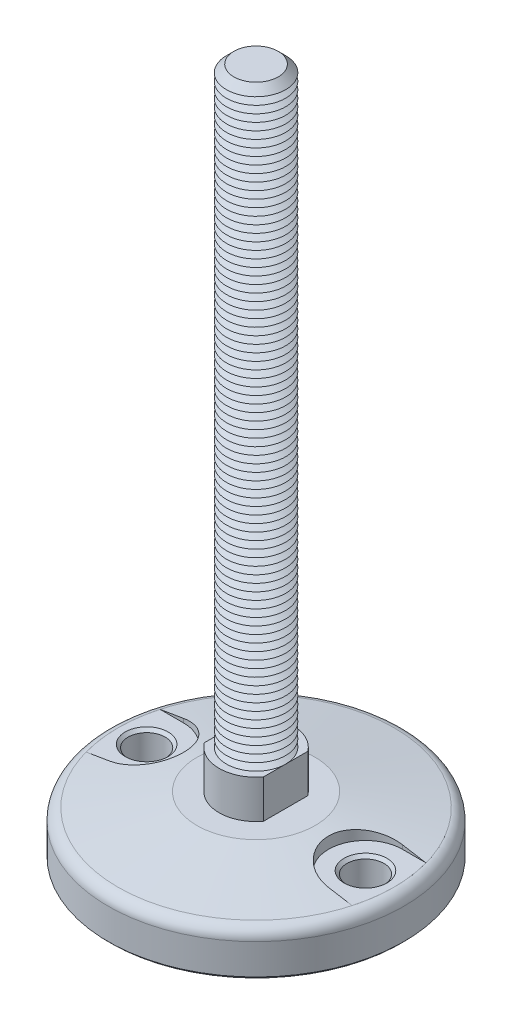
from build123d import *

# Parameters (mm, degrees)
FILLET1_R                = 4
SKETCH3_R                = 12.5
BOSS_EXTRUDE1_DEPTH      = 13
CUT_EXTRUDE1_START       = -13
CUT_EXTRUDE1_DEPTH       = 13
SKETCH5_R                = 10
BOSS_EXTRUDE2_DEPTH      = 200
CHAMFER1_SIZE            = 2.5
LPATTERN1_COUNT          = 79
LPATTERN1_PITCH          = 2.5
CUT_EXTRUDE4_DEPTH       = 4.7
SKETCH10_R               = 6.25
CUT_EXTRUDE5_DEPTH       = 15.3
CHAMFER2_SIZE            = 1
CHAMFER2_OF_MIRROR1_SIZE = 1
CHAMFER3_SIZE            = 1


with BuildPart() as part:
    # Sketch2 → Revolve1 (revolve)
    with BuildSketch(Plane(origin=(0, 0, 0), x_dir=(0, 0, -1), z_dir=(1, 0, 0))):
        Polygon((0, 0), (-20, 0), (-50, -5.289809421), (-50, -20), (0, -20), align=None)
    revolve(axis=Axis((0, 61.338865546, 0), (0, -1, 0)))

    # Fillet1
    fillet1_edges = [part.edges().sort_by_distance(p)[0] for p in [
        (0, -5.289809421, -50),
    ]]
    fillet(fillet1_edges, radius=FILLET1_R)

    # Sketch3 → Boss-Extrude1 (add)
    with BuildSketch(Plane(origin=(0, 0, 0), x_dir=(1, 0, 0), z_dir=(0, 1, 0))):
        with Locations(Location((0, 0, 0), (0, 0, 90))):
            Circle(SKETCH3_R)
    extrude(amount=BOSS_EXTRUDE1_DEPTH)

    # Sketch4 → Cut-Extrude1 (cut)
    with BuildSketch(Plane(origin=(0, 13, 0), x_dir=(1, 0, 0), z_dir=(0, 1, 0)).offset(CUT_EXTRUDE1_START)):
        with BuildLine():
            Line((-10, 7.5), (-10, -7.5))
            ThreePointArc((-10, -7.5), (-12.5, 0), (-10, 7.5))
        make_face()
        with BuildLine():
            Line((10, -7.5), (10, 7.5))
            ThreePointArc((10, 7.5), (12.5, 0), (10, -7.5))
        make_face()
    extrude(amount=CUT_EXTRUDE1_DEPTH, mode=Mode.SUBTRACT)

    # Sketch5 → Boss-Extrude2 (add)
    with BuildSketch(Plane(origin=(0, 13, 0), x_dir=(1, 0, 0), z_dir=(0, 1, 0))):
        with Locations(Location((0, 0, 0), (0, 0, 180))):
            Circle(SKETCH5_R)
    extrude(amount=BOSS_EXTRUDE2_DEPTH)

    # Chamfer1
    chamfer1_edges = [part.edges().sort_by_distance(p)[0] for p in [
        (10, 213, 0),
    ]]
    chamfer(chamfer1_edges, length=CHAMFER1_SIZE)

    # Sketch6 → Cut-Revolve1 (revolve, cut)
    with BuildSketch(Plane(origin=(0, 0, 0), x_dir=(0, 0, -1), z_dir=(1, 0, 0))):
        Polygon((-10, 13), (-7.834936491, 14.25), (-10, 15.5), align=None)
    cut_revolve1 = revolve(axis=Axis((0, 61.338865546, 0), (0, -1, 0)), mode=Mode.SUBTRACT)

    # LPattern1: Cut-Revolve1 ×79
    with Locations(*[(0, i * LPATTERN1_PITCH, 0) for i in range(1, LPATTERN1_COUNT)]):
        add(cut_revolve1, mode=Mode.SUBTRACT)

    # Sketch8 → Cut-Extrude4 (cut)
    with BuildSketch(Plane(origin=(0, 0, 0), x_dir=(1, 0, 0), z_dir=(0, 1, 0))):
        with BuildLine():
            Line((-37, 12.5), (-44.990387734, 12.5))
            ThreePointArc((-44.990387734, 12.5), (-46.694592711, 0), (-44.990387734, -12.5))
            Line((-44.990387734, -12.5), (-37, -12.5))
            ThreePointArc((-37, -12.5), (-24.5, 0), (-37, 12.5))
        make_face()
    cut_extrude4 = extrude(amount=-CUT_EXTRUDE4_DEPTH, mode=Mode.SUBTRACT)

    # Sketch10 → Cut-Extrude5 (cut)
    with BuildSketch(Plane(origin=(0, -4.7, 0), x_dir=(1, 0, 0), z_dir=(0, 1, 0))):
        with Locations(Location((-37, 0, 0), (0, 0, 270))):
            Circle(SKETCH10_R)
    cut_extrude5 = extrude(amount=-CUT_EXTRUDE5_DEPTH, mode=Mode.SUBTRACT)

    # Chamfer2
    chamfer2_edges = [part.edges().sort_by_distance(p)[0] for p in [
        (-37, -4.7, -6.25),
        (-37, -20, -6.25),
    ]]
    chamfer(chamfer2_edges, length=CHAMFER2_SIZE)

    # Mirror1: Cut-Extrude4, Cut-Extrude5 across plane
    add(cut_extrude4.mirror(Plane(origin=(0, 0, 0), x_dir=(0, 0, 1), z_dir=(1, 0, 0))), mode=Mode.SUBTRACT)
    add(cut_extrude5.mirror(Plane(origin=(0, 0, 0), x_dir=(0, 0, 1), z_dir=(1, 0, 0))), mode=Mode.SUBTRACT)

    # Chamfer2 of Mirror1
    chamfer2_of_mirror1_edges = [part.edges().sort_by_distance(p)[0] for p in [
        (37, -4.7, -6.25),
        (37, -20, -6.25),
    ]]
    chamfer(chamfer2_of_mirror1_edges, length=CHAMFER2_OF_MIRROR1_SIZE)

    # Chamfer3
    chamfer3_edges = [part.edges().sort_by_distance(p)[0] for p in [
        (0, -20, -50),
    ]]
    chamfer(chamfer3_edges, length=CHAMFER3_SIZE)


solid = part.part
